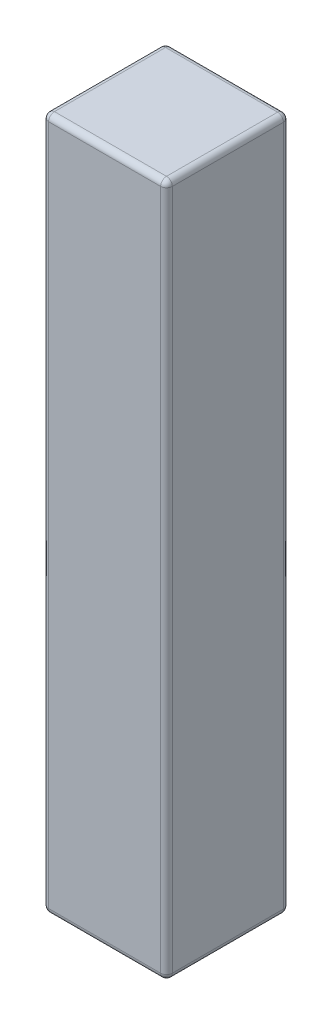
from build123d import *

# Parameters (mm, degrees)
SKETCH1_W      = 3.175
SKETCH1_H      = 3.1496
EXTRUDE1_DEPTH = 17.78
FILLET1_R      = 0.15


with BuildPart() as part:
    # Sketch1 → Extrude1 (new body)
    with BuildSketch(Plane(origin=(0, 0, 0), x_dir=(1, 0, 0), z_dir=(0, 1, 0))):
        Rectangle(SKETCH1_W, SKETCH1_H)
    extrude(amount=EXTRUDE1_DEPTH)

    # Fillet1
    fillet1_edges = [part.edges().sort_by_distance(p)[0] for p in [
        (1.5875, 17.78, 0),
        (0, 17.78, -1.5748),
        (-1.5875, 17.78, 0),
        (0, 0, -1.5748),
        (1.5875, 0, 0),
        (0, 0, 1.5748),
        (-1.5875, 0, 0),
        (0, 17.78, 1.5748),
        (-1.5875, 8.89, -1.5748),
        (1.5875, 8.89, -1.5748),
        (1.5875, 8.89, 1.5748),
        (-1.5875, 8.89, 1.5748),
    ]]
    fillet(fillet1_edges, radius=FILLET1_R)


solid = part.part
